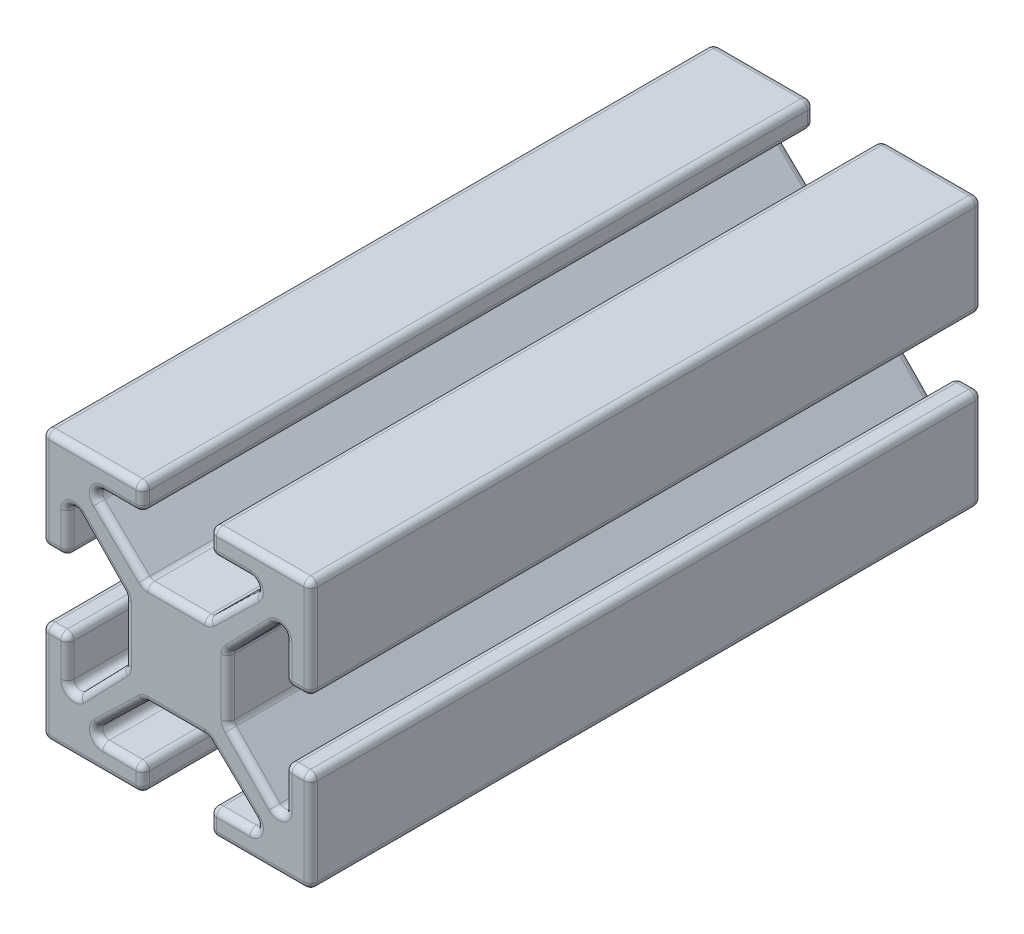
from build123d import *

# Parameters (mm, degrees)
BOSS_EXTRUDE1_DEPTH = 100
FILLET3_R           = 1


with BuildPart() as part:
    # Sketch1 → Boss-Extrude1 (new body)
    with BuildSketch(Plane.XY):
        Polygon((-5, 16.212568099), (-5, 20), (-20, 20), (-20, 5), (-16.212568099, 5), (-16.212568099, 13.432263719), (-7.689389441, 4.631155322), (-7.689389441, 0), (-7.689389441, -4.631155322), (-16.212568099, -13.432263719), (-16.212568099, -5), (-20, -5), (-20, -20), (-5, -20), (-5, -16.212568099), (-13.432263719, -16.212568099), (-4.631155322, -7.689389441), (0, -7.689389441), (4.631155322, -7.689389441), (13.432263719, -16.212568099), (5, -16.212568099), (5, -20), (20, -20), (20, -5), (16.212568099, -5), (16.212568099, -13.432263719), (7.689389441, -4.631155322), (7.689389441, 0), (7.689389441, 4.631155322), (16.212568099, 13.432263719), (16.212568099, 5), (20, 5), (20, 20), (5, 20), (5, 16.212568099), (13.432263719, 16.212568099), (4.631155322, 7.689389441), (0, 7.689389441), (-4.631155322, 7.689389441), (-13.432263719, 16.212568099), align=None)
    extrude(amount=BOSS_EXTRUDE1_DEPTH)

    # Fillet3
    fillet3_edges = [part.edges().sort_by_distance(p)[0] for p in [
        (0, 7.689389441, 100),
        (-9.03170952, 11.95097877, 100),
        (0, -7.689389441, 100),
        (-9.216131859, 16.212568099, 100),
        (-5, 18.10628405, 100),
        (-12.5, 20, 100),
        (-20, 12.5, 100),
        (-18.10628405, 5, 100),
        (-16.212568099, 9.216131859, 100),
        (-11.95097877, 9.03170952, 100),
        (-7.689389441, 0, 100),
        (-11.95097877, -9.03170952, 100),
        (-16.212568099, -9.216131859, 100),
        (-18.10628405, -5, 100),
        (-20, -12.5, 100),
        (-12.5, -20, 100),
        (9.031709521, -11.95097877, 100),
        (-5, -18.10628405, 100),
        (-9.216131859, -16.212568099, 100),
        (9.216131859, -16.212568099, 100),
        (5, -18.10628405, 100),
        (12.5, -20, 100),
        (20, -12.5, 100),
        (-9.216131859, -16.212568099, 0),
        (-5, -18.10628405, 0),
        (-12.5, -20, 0),
        (-20, -12.5, 0),
        (-18.10628405, -5, 0),
        (-16.212568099, -9.216131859, 0),
        (-11.95097877, -9.03170952, 0),
        (-7.689389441, 0, 0),
        (-11.95097877, 9.03170952, 0),
        (18.10628405, -5, 100),
        (-16.212568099, 9.216131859, 0),
        (-18.10628405, 5, 0),
        (-20, 12.5, 0),
        (-12.5, 20, 0),
        (-5, 18.10628405, 0),
        (-9.216131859, 16.212568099, 0),
        (-9.03170952, 11.95097877, 0),
        (0, 7.689389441, 0),
        (9.03170952, 11.95097877, 0),
        (9.216131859, 16.212568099, 0),
        (16.212568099, -9.216131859, 100),
        (5, 18.10628405, 0),
        (12.5, 20, 0),
        (20, 12.5, 0),
        (18.10628405, 5, 0),
        (16.212568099, 9.216131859, 0),
        (11.95097877, 9.03170952, 0),
        (7.689389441, 0, 0),
        (11.95097877, -9.03170952, 0),
        (16.212568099, -9.216131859, 0),
        (18.10628405, -5, 0),
        (11.95097877, -9.03170952, 100),
        (20, -12.5, 0),
        (12.5, -20, 0),
        (5, -18.10628405, 0),
        (9.216131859, -16.212568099, 0),
        (9.031709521, -11.95097877, 0),
        (0, -7.689389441, 0),
        (-9.03170952, -11.95097877, 0),
        (7.689389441, 0, 100),
        (-9.03170952, -11.95097877, 100),
        (11.95097877, 9.03170952, 100),
        (-13.432263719, -16.212568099, 50),
        (-5, -16.212568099, 50),
        (-5, -20, 50),
        (-20, -20, 50),
        (-20, -5, 50),
        (-16.212568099, -5, 50),
        (-16.212568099, -13.432263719, 50),
        (-7.689389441, -4.631155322, 50),
        (-7.689389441, 4.631155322, 50),
        (-16.212568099, 13.432263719, 50),
        (-16.212568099, 5, 50),
        (-20, 5, 50),
        (-20, 20, 50),
        (-5, 20, 50),
        (-5, 16.212568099, 50),
        (-13.432263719, 16.212568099, 50),
        (-4.631155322, 7.689389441, 50),
        (16.212568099, 9.216131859, 100),
        (4.631155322, 7.689389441, 50),
        (13.432263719, 16.212568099, 50),
        (5, 16.212568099, 50),
        (5, 20, 50),
        (20, 20, 50),
        (20, 5, 50),
        (16.212568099, 5, 50),
        (16.212568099, 13.432263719, 50),
        (7.689389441, 4.631155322, 50),
        (7.689389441, -4.631155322, 50),
        (16.212568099, -13.432263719, 50),
        (16.212568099, -5, 50),
        (20, -5, 50),
        (20, -20, 50),
        (5, -20, 50),
        (5, -16.212568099, 50),
        (13.432263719, -16.212568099, 50),
        (4.631155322, -7.689389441, 50),
        (-4.631155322, -7.689389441, 50),
        (18.10628405, 5, 100),
        (20, 12.5, 100),
        (12.5, 20, 100),
        (5, 18.10628405, 100),
        (9.216131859, 16.212568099, 100),
        (9.03170952, 11.95097877, 100),
    ]]
    fillet(fillet3_edges, radius=FILLET3_R)


solid = part.part
